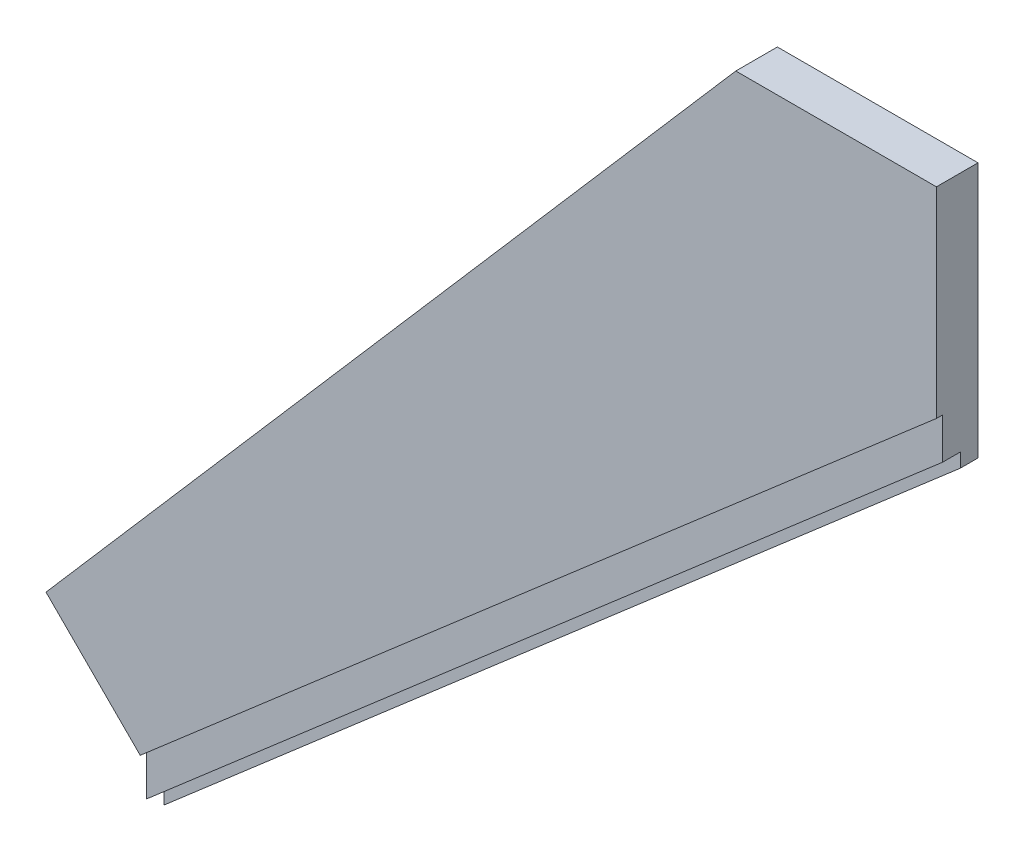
ISO-10303-21;
HEADER;
FILE_DESCRIPTION(('STEP AP214'),'2;1');
FILE_NAME('part.step','',(''),(''),'','','');
FILE_SCHEMA(('AUTOMOTIVE_DESIGN { 1 0 10303 214 1 1 1 1 }'));
ENDSEC;
DATA;
#1=APPLICATION_CONTEXT('core data for automotive mechanical design processes');
#2=APPLICATION_PROTOCOL_DEFINITION('international standard','automotive_design',2000,#1);
#3=PRODUCT_CONTEXT('',#1,'mechanical');
#4=PRODUCT('Part','Part','',(#3));
#5=PRODUCT_RELATED_PRODUCT_CATEGORY('part','',(#4));
#6=PRODUCT_DEFINITION_FORMATION('','',#4);
#7=PRODUCT_DEFINITION_CONTEXT('part definition',#1,'design');
#8=PRODUCT_DEFINITION('design','',#6,#7);
#9=PRODUCT_DEFINITION_SHAPE('','',#8);
#10=(LENGTH_UNIT() NAMED_UNIT(*) SI_UNIT(.MILLI.,.METRE.));
#11=(NAMED_UNIT(*) PLANE_ANGLE_UNIT() SI_UNIT($,.RADIAN.));
#12=(NAMED_UNIT(*) SI_UNIT($,.STERADIAN.) SOLID_ANGLE_UNIT());
#13=UNCERTAINTY_MEASURE_WITH_UNIT(LENGTH_MEASURE(1.E-05),#10,'distance_accuracy_value','');
#14=(GEOMETRIC_REPRESENTATION_CONTEXT(3) GLOBAL_UNCERTAINTY_ASSIGNED_CONTEXT((#13)) GLOBAL_UNIT_ASSIGNED_CONTEXT((#10,
#11,#12)) REPRESENTATION_CONTEXT('',''));
#15=CARTESIAN_POINT('',(0.,0.,0.));
#16=DIRECTION('',(0.,0.,1.));
#17=DIRECTION('',(1.,0.,0.));
#18=AXIS2_PLACEMENT_3D('',#15,#16,#17);
#19=CARTESIAN_POINT('',(0.,0.,47.));
#20=DIRECTION('',(-1.,0.,0.));
#21=DIRECTION('',(0.,-1.,0.));
#22=AXIS2_PLACEMENT_3D('',#19,#20,#21);
#23=PLANE('',#22);
#24=DIRECTION('',(0.,1.,0.));
#25=VECTOR('',#24,1.);
#26=CARTESIAN_POINT('',(0.,0.,0.));
#27=LINE('',#26,#25);
#28=CARTESIAN_POINT('',(0.,-288.96801019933,0.));
#29=VERTEX_POINT('',#28);
#30=CARTESIAN_POINT('',(0.,0.,0.));
#31=VERTEX_POINT('',#30);
#32=EDGE_CURVE('E106',#29,#31,#27,.T.);
#33=ORIENTED_EDGE('',*,*,#32,.T.);
#34=DIRECTION('',(0.,0.,-1.));
#35=VECTOR('',#34,1.);
#36=CARTESIAN_POINT('',(0.,0.,47.));
#37=LINE('',#36,#35);
#38=CARTESIAN_POINT('',(0.,0.,47.));
#39=VERTEX_POINT('',#38);
#40=EDGE_CURVE('E11',#39,#31,#37,.T.);
#41=ORIENTED_EDGE('',*,*,#40,.F.);
#42=DIRECTION('',(0.,1.,0.));
#43=VECTOR('',#42,1.);
#44=CARTESIAN_POINT('',(0.,0.,47.));
#45=LINE('',#44,#43);
#46=CARTESIAN_POINT('',(0.,-226.78324876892,47.));
#47=VERTEX_POINT('',#46);
#48=EDGE_CURVE('E163',#47,#39,#45,.T.);
#49=ORIENTED_EDGE('',*,*,#48,.F.);
#50=DIRECTION('',(0.,0.,-1.));
#51=VECTOR('',#50,1.);
#52=CARTESIAN_POINT('',(0.,-226.78324876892,47.));
#53=LINE('',#52,#51);
#54=CARTESIAN_POINT('',(0.,-226.78324876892,40.));
#55=VERTEX_POINT('',#54);
#56=EDGE_CURVE('E174',#47,#55,#53,.T.);
#57=ORIENTED_EDGE('',*,*,#56,.T.);
#58=DIRECTION('',(0.,-1.,0.));
#59=VECTOR('',#58,1.);
#60=CARTESIAN_POINT('',(0.,-226.78324876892,40.));
#61=LINE('',#60,#59);
#62=CARTESIAN_POINT('',(1.12817683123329E-13,-273.091049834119,40.));
#63=VERTEX_POINT('',#62);
#64=EDGE_CURVE('E143',#55,#63,#61,.T.);
#65=ORIENTED_EDGE('',*,*,#64,.T.);
#66=DIRECTION('',(0.,0.,-1.));
#67=VECTOR('',#66,1.);
#68=CARTESIAN_POINT('',(1.12817683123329E-13,-273.091049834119,40.));
#69=LINE('',#68,#67);
#70=CARTESIAN_POINT('',(1.12817683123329E-13,-273.091049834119,20.));
#71=VERTEX_POINT('',#70);
#72=EDGE_CURVE('E152',#63,#71,#69,.T.);
#73=ORIENTED_EDGE('',*,*,#72,.T.);
#74=DIRECTION('',(0.,-1.,0.));
#75=VECTOR('',#74,1.);
#76=CARTESIAN_POINT('',(1.12817683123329E-13,-273.091049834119,20.));
#77=LINE('',#76,#75);
#78=CARTESIAN_POINT('',(0.,-288.96801019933,20.));
#79=VERTEX_POINT('',#78);
#80=EDGE_CURVE('E120',#71,#79,#77,.T.);
#81=ORIENTED_EDGE('',*,*,#80,.T.);
#82=DIRECTION('',(0.,0.,-1.));
#83=VECTOR('',#82,1.);
#84=CARTESIAN_POINT('',(0.,-288.96801019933,20.));
#85=LINE('',#84,#83);
#86=EDGE_CURVE('E118',#79,#29,#85,.T.);
#87=ORIENTED_EDGE('',*,*,#86,.T.);
#88=EDGE_LOOP('',(#33,#41,#49,#57,#65,#73,#81,#87));
#89=FACE_BOUND('',#88,.T.);
#90=ADVANCED_FACE('F31',(#89),#23,.F.);
#91=CARTESIAN_POINT('',(0.,0.,47.));
#92=DIRECTION('',(0.,-1.,0.));
#93=DIRECTION('',(1.,0.,0.));
#94=AXIS2_PLACEMENT_3D('',#91,#92,#93);
#95=PLANE('',#94);
#96=DIRECTION('',(-1.,0.,0.));
#97=VECTOR('',#96,1.);
#98=CARTESIAN_POINT('',(0.,0.,0.));
#99=LINE('',#98,#97);
#100=CARTESIAN_POINT('',(-226.783248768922,0.,0.));
#101=VERTEX_POINT('',#100);
#102=EDGE_CURVE('E113',#31,#101,#99,.T.);
#103=ORIENTED_EDGE('',*,*,#102,.T.);
#104=DIRECTION('',(0.,0.,-1.));
#105=VECTOR('',#104,1.);
#106=CARTESIAN_POINT('',(-226.783248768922,0.,47.));
#107=LINE('',#106,#105);
#108=CARTESIAN_POINT('',(-226.783248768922,0.,47.));
#109=VERTEX_POINT('',#108);
#110=EDGE_CURVE('E38',#109,#101,#107,.T.);
#111=ORIENTED_EDGE('',*,*,#110,.F.);
#112=DIRECTION('',(-1.,0.,0.));
#113=VECTOR('',#112,1.);
#114=CARTESIAN_POINT('',(0.,0.,47.));
#115=LINE('',#114,#113);
#116=EDGE_CURVE('E166',#39,#109,#115,.T.);
#117=ORIENTED_EDGE('',*,*,#116,.F.);
#118=ORIENTED_EDGE('',*,*,#40,.T.);
#119=EDGE_LOOP('',(#103,#111,#117,#118));
#120=FACE_BOUND('',#119,.T.);
#121=ADVANCED_FACE('F202',(#120),#95,.F.);
#122=CARTESIAN_POINT('',(-226.783248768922,0.,47.));
#123=DIRECTION('',(0.755812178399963,-0.654788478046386,0.));
#124=DIRECTION('',(0.654788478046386,0.755812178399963,0.));
#125=AXIS2_PLACEMENT_3D('',#122,#123,#124);
#126=PLANE('',#125);
#127=DIRECTION('',(-0.654788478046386,-0.755812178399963,0.));
#128=VECTOR('',#127,1.);
#129=CARTESIAN_POINT('',(-226.783248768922,0.,0.));
#130=LINE('',#129,#128);
#131=CARTESIAN_POINT('',(-1006.48705228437,-900.,0.));
#132=VERTEX_POINT('',#131);
#133=EDGE_CURVE('E159',#101,#132,#130,.T.);
#134=ORIENTED_EDGE('',*,*,#133,.T.);
#135=DIRECTION('',(0.,0.,-1.));
#136=VECTOR('',#135,1.);
#137=CARTESIAN_POINT('',(-1006.48705228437,-900.,47.));
#138=LINE('',#137,#136);
#139=CARTESIAN_POINT('',(-1006.48705228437,-900.,47.));
#140=VERTEX_POINT('',#139);
#141=EDGE_CURVE('E178',#140,#132,#138,.T.);
#142=ORIENTED_EDGE('',*,*,#141,.F.);
#143=DIRECTION('',(-0.654788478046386,-0.755812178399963,0.));
#144=VECTOR('',#143,1.);
#145=CARTESIAN_POINT('',(-226.783248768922,0.,47.));
#146=LINE('',#145,#144);
#147=EDGE_CURVE('E168',#109,#140,#146,.T.);
#148=ORIENTED_EDGE('',*,*,#147,.F.);
#149=ORIENTED_EDGE('',*,*,#110,.T.);
#150=EDGE_LOOP('',(#134,#142,#148,#149));
#151=FACE_BOUND('',#150,.T.);
#152=ADVANCED_FACE('F184',(#151),#126,.F.);
#153=CARTESIAN_POINT('',(-1006.48705228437,-900.,47.));
#154=DIRECTION('',(0.707106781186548,0.707106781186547,0.));
#155=DIRECTION('',(-0.707106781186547,0.707106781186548,0.));
#156=AXIS2_PLACEMENT_3D('',#153,#154,#155);
#157=PLANE('',#156);
#158=DIRECTION('',(0.707106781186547,-0.707106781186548,0.));
#159=VECTOR('',#158,1.);
#160=CARTESIAN_POINT('',(-1006.48705228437,-900.,0.));
#161=LINE('',#160,#159);
#162=CARTESIAN_POINT('',(-900.,-1006.48705228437,0.));
#163=VERTEX_POINT('',#162);
#164=EDGE_CURVE('E161',#132,#163,#161,.T.);
#165=ORIENTED_EDGE('',*,*,#164,.T.);
#166=DIRECTION('',(0.,0.,-1.));
#167=VECTOR('',#166,1.);
#168=CARTESIAN_POINT('',(-900.,-1006.48705228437,40.));
#169=LINE('',#168,#167);
#170=CARTESIAN_POINT('',(-900.,-1006.48705228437,40.));
#171=VERTEX_POINT('',#170);
#172=EDGE_CURVE('E45',#171,#163,#169,.T.);
#173=ORIENTED_EDGE('',*,*,#172,.F.);
#174=DIRECTION('',(0.,0.,-1.));
#175=VECTOR('',#174,1.);
#176=CARTESIAN_POINT('',(-900.,-1006.48705228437,47.));
#177=LINE('',#176,#175);
#178=CARTESIAN_POINT('',(-900.,-1006.48705228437,47.));
#179=VERTEX_POINT('',#178);
#180=EDGE_CURVE('E176',#179,#171,#177,.T.);
#181=ORIENTED_EDGE('',*,*,#180,.F.);
#182=DIRECTION('',(0.707106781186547,-0.707106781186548,0.));
#183=VECTOR('',#182,1.);
#184=CARTESIAN_POINT('',(-1006.48705228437,-900.,47.));
#185=LINE('',#184,#183);
#186=EDGE_CURVE('E170',#140,#179,#185,.T.);
#187=ORIENTED_EDGE('',*,*,#186,.F.);
#188=ORIENTED_EDGE('',*,*,#141,.T.);
#189=EDGE_LOOP('',(#165,#173,#181,#187,#188));
#190=FACE_BOUND('',#189,.T.);
#191=ADVANCED_FACE('F188',(#190),#157,.F.);
#192=CARTESIAN_POINT('',(0.,-226.78324876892,47.));
#193=DIRECTION('',(-0.654788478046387,0.755812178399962,0.));
#194=DIRECTION('',(-0.755812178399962,-0.654788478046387,0.));
#195=AXIS2_PLACEMENT_3D('',#192,#193,#194);
#196=PLANE('',#195);
#197=ORIENTED_EDGE('',*,*,#180,.T.);
#198=DIRECTION('',(0.755812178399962,0.654788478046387,0.));
#199=VECTOR('',#198,1.);
#200=CARTESIAN_POINT('',(0.,-226.78324876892,40.));
#201=LINE('',#200,#199);
#202=EDGE_CURVE('E52',#171,#55,#201,.T.);
#203=ORIENTED_EDGE('',*,*,#202,.T.);
#204=ORIENTED_EDGE('',*,*,#56,.F.);
#205=DIRECTION('',(0.755812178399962,0.654788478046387,0.));
#206=VECTOR('',#205,1.);
#207=CARTESIAN_POINT('',(0.,-226.78324876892,47.));
#208=LINE('',#207,#206);
#209=EDGE_CURVE('E172',#179,#47,#208,.T.);
#210=ORIENTED_EDGE('',*,*,#209,.F.);
#211=EDGE_LOOP('',(#197,#203,#204,#210));
#212=FACE_BOUND('',#211,.T.);
#213=ADVANCED_FACE('F199',(#212),#196,.F.);
#214=CARTESIAN_POINT('',(0.,0.,47.));
#215=DIRECTION('',(0.,0.,-1.));
#216=DIRECTION('',(-1.,0.,0.));
#217=AXIS2_PLACEMENT_3D('',#214,#215,#216);
#218=PLANE('',#217);
#219=ORIENTED_EDGE('',*,*,#48,.T.);
#220=ORIENTED_EDGE('',*,*,#116,.T.);
#221=ORIENTED_EDGE('',*,*,#147,.T.);
#222=ORIENTED_EDGE('',*,*,#186,.T.);
#223=ORIENTED_EDGE('',*,*,#209,.T.);
#224=EDGE_LOOP('',(#219,#220,#221,#222,#223));
#225=FACE_BOUND('',#224,.T.);
#226=ADVANCED_FACE('F201',(#225),#218,.F.);
#227=CARTESIAN_POINT('',(0.,0.,0.));
#228=DIRECTION('',(0.,0.,-1.));
#229=DIRECTION('',(-1.,0.,0.));
#230=AXIS2_PLACEMENT_3D('',#227,#228,#229);
#231=PLANE('',#230);
#232=ORIENTED_EDGE('',*,*,#32,.F.);
#233=DIRECTION('',(-0.755812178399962,-0.654788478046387,0.));
#234=VECTOR('',#233,1.);
#235=CARTESIAN_POINT('',(-900.,-1068.67181371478,0.));
#236=LINE('',#235,#234);
#237=CARTESIAN_POINT('',(-900.,-1068.67181371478,0.));
#238=VERTEX_POINT('',#237);
#239=EDGE_CURVE('E111',#29,#238,#236,.T.);
#240=ORIENTED_EDGE('',*,*,#239,.T.);
#241=DIRECTION('',(0.,1.,0.));
#242=VECTOR('',#241,1.);
#243=CARTESIAN_POINT('',(-900.,-1006.48705228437,0.));
#244=LINE('',#243,#242);
#245=EDGE_CURVE('E139',#238,#163,#244,.T.);
#246=ORIENTED_EDGE('',*,*,#245,.T.);
#247=ORIENTED_EDGE('',*,*,#164,.F.);
#248=ORIENTED_EDGE('',*,*,#133,.F.);
#249=ORIENTED_EDGE('',*,*,#102,.F.);
#250=EDGE_LOOP('',(#232,#240,#246,#247,#248,#249));
#251=FACE_BOUND('',#250,.T.);
#252=ADVANCED_FACE('F108',(#251),#231,.T.);
#253=CARTESIAN_POINT('',(-900.,-1006.48705228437,40.));
#254=DIRECTION('',(-1.,0.,0.));
#255=DIRECTION('',(0.,0.,1.));
#256=AXIS2_PLACEMENT_3D('',#253,#254,#255);
#257=PLANE('',#256);
#258=ORIENTED_EDGE('',*,*,#245,.F.);
#259=DIRECTION('',(0.,0.,-1.));
#260=VECTOR('',#259,1.);
#261=CARTESIAN_POINT('',(-900.,-1068.67181371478,20.));
#262=LINE('',#261,#260);
#263=CARTESIAN_POINT('',(-900.,-1068.67181371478,20.));
#264=VERTEX_POINT('',#263);
#265=EDGE_CURVE('E124',#264,#238,#262,.T.);
#266=ORIENTED_EDGE('',*,*,#265,.F.);
#267=DIRECTION('',(0.,1.,0.));
#268=VECTOR('',#267,1.);
#269=CARTESIAN_POINT('',(-900.,-1052.79485334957,20.));
#270=LINE('',#269,#268);
#271=CARTESIAN_POINT('',(-900.,-1052.79485334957,20.));
#272=VERTEX_POINT('',#271);
#273=EDGE_CURVE('E125',#264,#272,#270,.T.);
#274=ORIENTED_EDGE('',*,*,#273,.T.);
#275=DIRECTION('',(0.,0.,-1.));
#276=VECTOR('',#275,1.);
#277=CARTESIAN_POINT('',(-900.,-1052.79485334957,40.));
#278=LINE('',#277,#276);
#279=CARTESIAN_POINT('',(-900.,-1052.79485334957,40.));
#280=VERTEX_POINT('',#279);
#281=EDGE_CURVE('E154',#280,#272,#278,.T.);
#282=ORIENTED_EDGE('',*,*,#281,.F.);
#283=DIRECTION('',(0.,1.,0.));
#284=VECTOR('',#283,1.);
#285=CARTESIAN_POINT('',(-900.,-1006.48705228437,40.));
#286=LINE('',#285,#284);
#287=EDGE_CURVE('E149',#280,#171,#286,.T.);
#288=ORIENTED_EDGE('',*,*,#287,.T.);
#289=ORIENTED_EDGE('',*,*,#172,.T.);
#290=EDGE_LOOP('',(#258,#266,#274,#282,#288,#289));
#291=FACE_BOUND('',#290,.T.);
#292=ADVANCED_FACE('F191',(#291),#257,.T.);
#293=CARTESIAN_POINT('',(-900.,-1052.79485334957,40.));
#294=DIRECTION('',(0.654788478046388,-0.755812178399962,0.));
#295=DIRECTION('',(0.755812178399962,0.654788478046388,0.));
#296=AXIS2_PLACEMENT_3D('',#293,#294,#295);
#297=PLANE('',#296);
#298=DIRECTION('',(0.755812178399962,0.654788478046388,0.));
#299=VECTOR('',#298,1.);
#300=CARTESIAN_POINT('',(1.12817683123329E-13,-273.091049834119,20.));
#301=LINE('',#300,#299);
#302=EDGE_CURVE('E129',#272,#71,#301,.T.);
#303=ORIENTED_EDGE('',*,*,#302,.T.);
#304=ORIENTED_EDGE('',*,*,#72,.F.);
#305=DIRECTION('',(-0.755812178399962,-0.654788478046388,0.));
#306=VECTOR('',#305,1.);
#307=CARTESIAN_POINT('',(-900.,-1052.79485334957,40.));
#308=LINE('',#307,#306);
#309=EDGE_CURVE('E146',#63,#280,#308,.T.);
#310=ORIENTED_EDGE('',*,*,#309,.T.);
#311=ORIENTED_EDGE('',*,*,#281,.T.);
#312=EDGE_LOOP('',(#303,#304,#310,#311));
#313=FACE_BOUND('',#312,.T.);
#314=ADVANCED_FACE('F218',(#313),#297,.T.);
#315=CARTESIAN_POINT('',(0.,-226.78324876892,40.));
#316=DIRECTION('',(0.,0.,1.));
#317=DIRECTION('',(1.,0.,0.));
#318=AXIS2_PLACEMENT_3D('',#315,#316,#317);
#319=PLANE('',#318);
#320=ORIENTED_EDGE('',*,*,#202,.F.);
#321=ORIENTED_EDGE('',*,*,#287,.F.);
#322=ORIENTED_EDGE('',*,*,#309,.F.);
#323=ORIENTED_EDGE('',*,*,#64,.F.);
#324=EDGE_LOOP('',(#320,#321,#322,#323));
#325=FACE_BOUND('',#324,.T.);
#326=ADVANCED_FACE('F195',(#325),#319,.T.);
#327=CARTESIAN_POINT('',(-900.,-1068.67181371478,20.));
#328=DIRECTION('',(0.654788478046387,-0.755812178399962,0.));
#329=DIRECTION('',(0.755812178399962,0.654788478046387,0.));
#330=AXIS2_PLACEMENT_3D('',#327,#328,#329);
#331=PLANE('',#330);
#332=ORIENTED_EDGE('',*,*,#239,.F.);
#333=ORIENTED_EDGE('',*,*,#86,.F.);
#334=DIRECTION('',(-0.755812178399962,-0.654788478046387,0.));
#335=VECTOR('',#334,1.);
#336=CARTESIAN_POINT('',(-900.,-1068.67181371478,20.));
#337=LINE('',#336,#335);
#338=EDGE_CURVE('E135',#79,#264,#337,.T.);
#339=ORIENTED_EDGE('',*,*,#338,.T.);
#340=ORIENTED_EDGE('',*,*,#265,.T.);
#341=EDGE_LOOP('',(#332,#333,#339,#340));
#342=FACE_BOUND('',#341,.T.);
#343=ADVANCED_FACE('F128',(#342),#331,.T.);
#344=CARTESIAN_POINT('',(-900.,-1052.79485334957,20.));
#345=DIRECTION('',(0.,0.,1.));
#346=DIRECTION('',(1.,0.,0.));
#347=AXIS2_PLACEMENT_3D('',#344,#345,#346);
#348=PLANE('',#347);
#349=ORIENTED_EDGE('',*,*,#302,.F.);
#350=ORIENTED_EDGE('',*,*,#273,.F.);
#351=ORIENTED_EDGE('',*,*,#338,.F.);
#352=ORIENTED_EDGE('',*,*,#80,.F.);
#353=EDGE_LOOP('',(#349,#350,#351,#352));
#354=FACE_BOUND('',#353,.T.);
#355=ADVANCED_FACE('F228',(#354),#348,.T.);
#356=CLOSED_SHELL('',(#90,#121,#152,#191,#213,#226,#252,#292,#314,#326,#343,#355));
#357=MANIFOLD_SOLID_BREP('B2',#356);
#358=ADVANCED_BREP_SHAPE_REPRESENTATION('',(#18,#357),#14);
#359=SHAPE_DEFINITION_REPRESENTATION(#9,#358);
ENDSEC;
END-ISO-10303-21;
